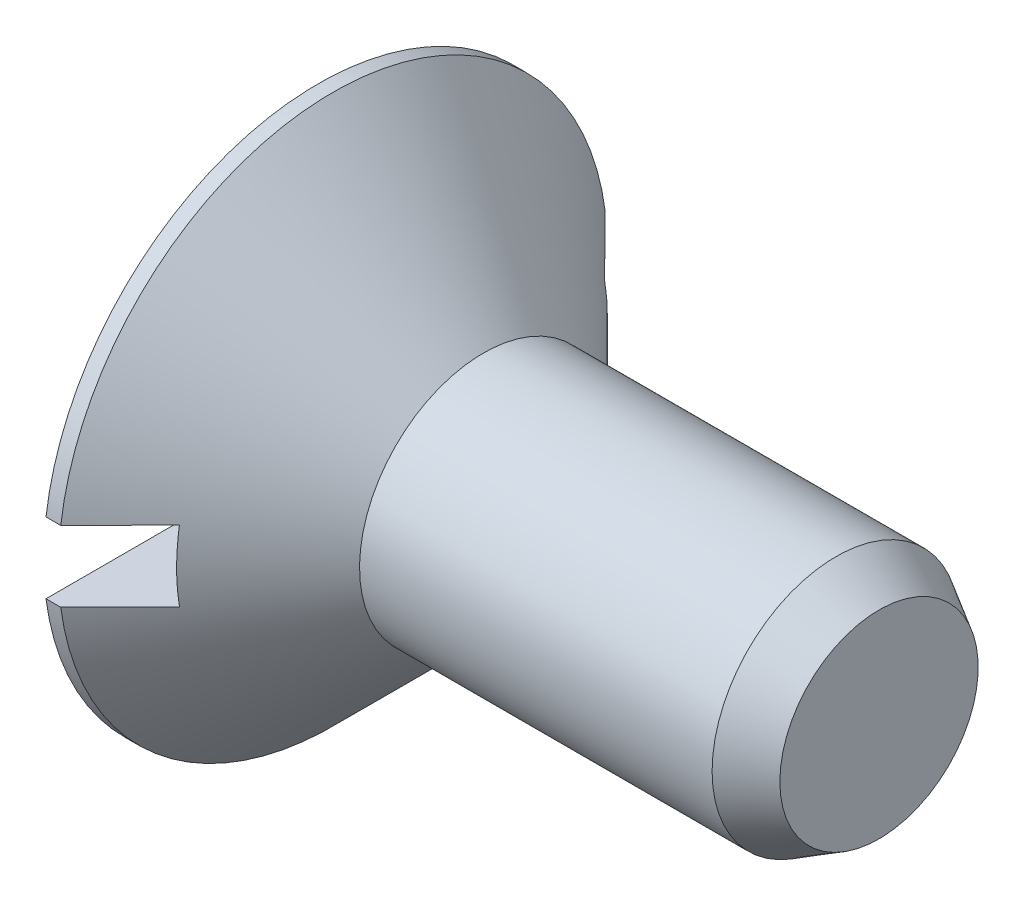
from build123d import *

# Parameters (mm, degrees)
CUT_EXTRUDE1_DEPTH      = 12.554003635
CUT_EXTRUDE1_DEPTH_BACK = 12.554003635
SKETCH2_W               = 1.25
SKETCH2_H               = 1.2
CHAMFER1_SIZE           = 0.42
CHAMFER1_SIZE2          = 0.727461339


with BuildPart() as part:
    # Sketch1 → Revolve1 (revolve)
    with BuildSketch(Plane.XY, mode=Mode.PRIVATE) as revolve1_sk:
        Polygon((0, 4.65), (0.25, 4.65), (2.8, 2.1), (9.5, 2.1), (9.5, 0), (0, 0), align=None)
    revolve(revolve1_sk.sketch.rotate(Axis((6.620684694, 0, 0), (-1, 0, 0)), 90), axis=Axis((6.620684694, 0, 0), (-1, 0, 0)))

    # Sketch2 → Cut-Extrude1 (cut, two sides: drawn at the far end of the back side and taken through both)
    with BuildSketch(Plane.XY.offset(-CUT_EXTRUDE1_DEPTH_BACK)):
        with Locations((0.625, 0)):
            Rectangle(SKETCH2_W, SKETCH2_H)
    extrude(amount=CUT_EXTRUDE1_DEPTH + CUT_EXTRUDE1_DEPTH_BACK, mode=Mode.SUBTRACT)

    # Chamfer1
    chamfer1_edges = [part.edges().sort_by_distance(p)[0] for p in [
        (9.5, 0, 2.1),
    ]]
    chamfer1_side = [part.faces().sort_by_distance(p)[0] for p in [
        (9.5, 0, 0),
    ]]
    chamfer(chamfer1_edges, length=CHAMFER1_SIZE, length2=CHAMFER1_SIZE2, reference=chamfer1_side[0])


solid = part.part
